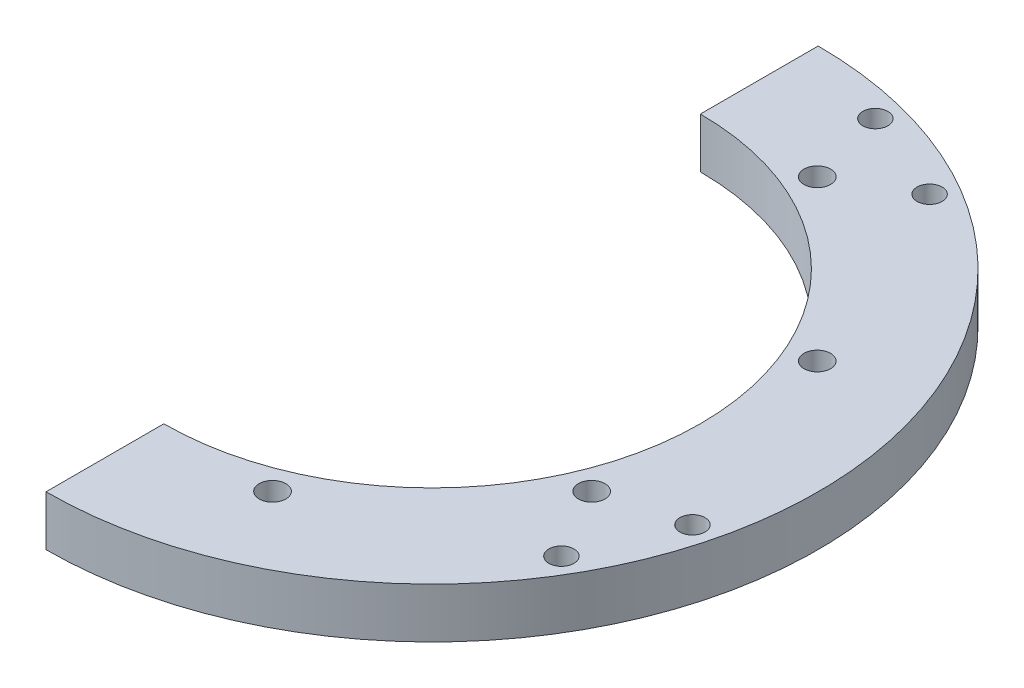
from build123d import *

# Parameters (mm, degrees)
BOSS_EXTRUDE1_DEPTH     = 12.7
F_1_4_CLEARANCE_HOLE2_D = 6.7564
F_1_4_20_TAPPED_HOLE3_D = 6.35
CIRPATTERN6_COUNT       = 4
CIRPATTERN6_ANGLE       = 135
CIRPATTERN7_COUNT       = 2
CIRPATTERN7_ANGLE       = 90


with BuildPart() as part:
    # Sketch16 → Boss-Extrude1 (new body)
    with BuildSketch(Plane(origin=(0, 0, 0), x_dir=(1, 0, 0), z_dir=(0, 1, 0))):
        with BuildLine():
            Line((0, 97.79), (0, 67.945))
            ThreePointArc((0, 67.945), (67.945, 0), (0, -67.945))
            Line((0, -67.945), (0, -97.79))
            ThreePointArc((0, -97.79), (97.79, 0), (0, 97.79))
        make_face()
    extrude(amount=BOSS_EXTRUDE1_DEPTH)

    # 1_4 Clearance Hole2 (through all)
    with Locations(Plane(origin=(0, 12.7, 0), x_dir=(1, 0, 0), z_dir=(0, 1, 0))):
        with Locations((28.577267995, 68.99162797)):
            f_1_4_clearance_hole2 = Hole(F_1_4_CLEARANCE_HOLE2_D / 2)

    # 1_4-20 Tapped Hole3 (through all)
    with Locations(Plane(origin=(0, 12.7, 0), x_dir=(1, 0, 0), z_dir=(0, 1, 0))):
        with Locations((23.165519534, 89.113210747), (46.63205966, 79.393051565)):
            f_1_4_20_tapped_hole3 = Hole(F_1_4_20_TAPPED_HOLE3_D / 2)

    # CirPattern6: 1_4 Clearance Hole2 ×4 about axis
    cirpattern6_axis = Axis((0, 0, 0), (0, -1, 0))
    for i in range(1, CIRPATTERN6_COUNT):
        add(f_1_4_clearance_hole2.rotate(cirpattern6_axis, i * CIRPATTERN6_ANGLE / (CIRPATTERN6_COUNT - 1)), mode=Mode.SUBTRACT)

    # CirPattern7: 1_4-20 Tapped Hole3 ×2 about axis
    cirpattern7_axis = Axis((0, 0, 0), (0, -1, 0))
    for i in range(1, CIRPATTERN7_COUNT):
        add(f_1_4_20_tapped_hole3.rotate(cirpattern7_axis, i * CIRPATTERN7_ANGLE / (CIRPATTERN7_COUNT - 1)), mode=Mode.SUBTRACT)


solid = part.part
